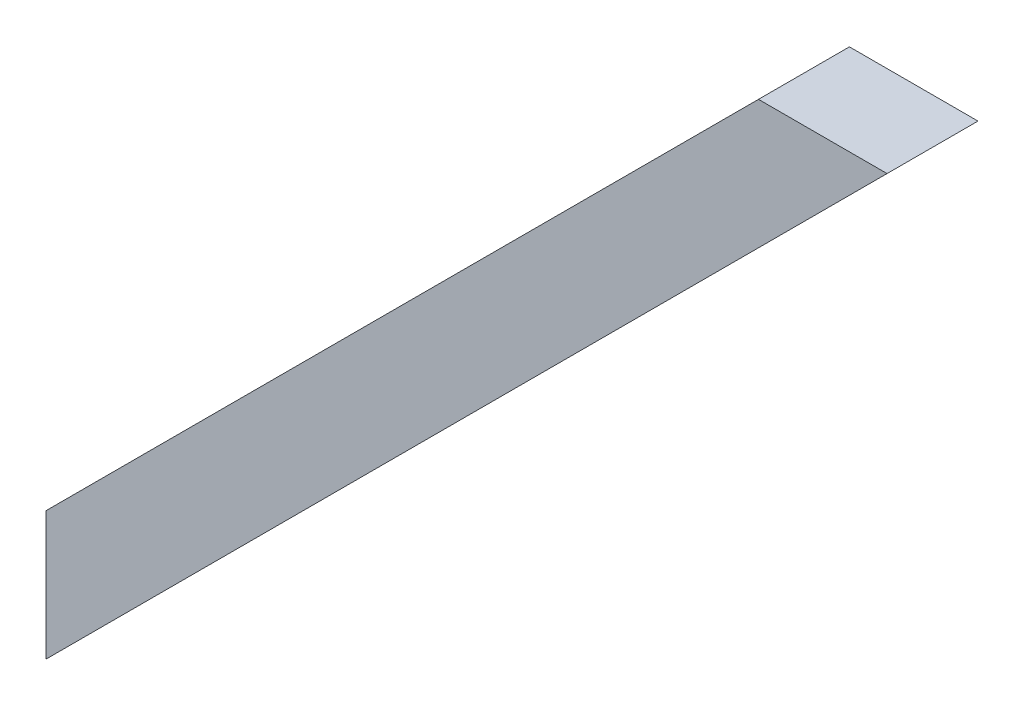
ISO-10303-21;
HEADER;
FILE_DESCRIPTION(('STEP AP214'),'2;1');
FILE_NAME('part.step','',(''),(''),'','','');
FILE_SCHEMA(('AUTOMOTIVE_DESIGN { 1 0 10303 214 1 1 1 1 }'));
ENDSEC;
DATA;
#1=APPLICATION_CONTEXT('core data for automotive mechanical design processes');
#2=APPLICATION_PROTOCOL_DEFINITION('international standard','automotive_design',2000,#1);
#3=PRODUCT_CONTEXT('',#1,'mechanical');
#4=PRODUCT('Part','Part','',(#3));
#5=PRODUCT_RELATED_PRODUCT_CATEGORY('part','',(#4));
#6=PRODUCT_DEFINITION_FORMATION('','',#4);
#7=PRODUCT_DEFINITION_CONTEXT('part definition',#1,'design');
#8=PRODUCT_DEFINITION('design','',#6,#7);
#9=PRODUCT_DEFINITION_SHAPE('','',#8);
#10=(LENGTH_UNIT() NAMED_UNIT(*) SI_UNIT(.MILLI.,.METRE.));
#11=(NAMED_UNIT(*) PLANE_ANGLE_UNIT() SI_UNIT($,.RADIAN.));
#12=(NAMED_UNIT(*) SI_UNIT($,.STERADIAN.) SOLID_ANGLE_UNIT());
#13=UNCERTAINTY_MEASURE_WITH_UNIT(LENGTH_MEASURE(1.E-05),#10,'distance_accuracy_value','');
#14=(GEOMETRIC_REPRESENTATION_CONTEXT(3) GLOBAL_UNCERTAINTY_ASSIGNED_CONTEXT((#13)) GLOBAL_UNIT_ASSIGNED_CONTEXT((#10,
#11,#12)) REPRESENTATION_CONTEXT('',''));
#15=CARTESIAN_POINT('',(0.,0.,0.));
#16=DIRECTION('',(0.,0.,1.));
#17=DIRECTION('',(1.,0.,0.));
#18=AXIS2_PLACEMENT_3D('',#15,#16,#17);
#19=CARTESIAN_POINT('',(0.,0.,-40.));
#20=DIRECTION('',(-1.,0.,0.));
#21=DIRECTION('',(0.,-1.,0.));
#22=AXIS2_PLACEMENT_3D('',#19,#20,#21);
#23=PLANE('',#22);
#24=DIRECTION('',(0.,-1.,0.));
#25=VECTOR('',#24,1.);
#26=CARTESIAN_POINT('',(0.,0.,0.));
#27=LINE('',#26,#25);
#28=CARTESIAN_POINT('',(-5.55111512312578E-12,56.5685424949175,0.));
#29=VERTEX_POINT('',#28);
#30=CARTESIAN_POINT('',(0.,0.,0.));
#31=VERTEX_POINT('',#30);
#32=EDGE_CURVE('E92',#29,#31,#27,.T.);
#33=ORIENTED_EDGE('',*,*,#32,.F.);
#34=DIRECTION('',(0.,0.,1.));
#35=VECTOR('',#34,1.);
#36=CARTESIAN_POINT('',(-5.60662627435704E-12,56.5685424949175,-40.));
#37=LINE('',#36,#35);
#38=CARTESIAN_POINT('',(-5.60662627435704E-12,56.5685424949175,-40.));
#39=VERTEX_POINT('',#38);
#40=EDGE_CURVE('E11',#39,#29,#37,.T.);
#41=ORIENTED_EDGE('',*,*,#40,.F.);
#42=DIRECTION('',(0.,-1.,0.));
#43=VECTOR('',#42,1.);
#44=CARTESIAN_POINT('',(0.,0.,-40.));
#45=LINE('',#44,#43);
#46=CARTESIAN_POINT('',(0.,0.,-40.));
#47=VERTEX_POINT('',#46);
#48=EDGE_CURVE('E86',#39,#47,#45,.T.);
#49=ORIENTED_EDGE('',*,*,#48,.T.);
#50=DIRECTION('',(0.,0.,1.));
#51=VECTOR('',#50,1.);
#52=CARTESIAN_POINT('',(0.,0.,-40.));
#53=LINE('',#52,#51);
#54=EDGE_CURVE('E31',#47,#31,#53,.T.);
#55=ORIENTED_EDGE('',*,*,#54,.T.);
#56=EDGE_LOOP('',(#33,#41,#49,#55));
#57=FACE_BOUND('',#56,.T.);
#58=ADVANCED_FACE('F28',(#57),#23,.T.);
#59=CARTESIAN_POINT('',(-5.60662627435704E-12,56.5685424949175,-40.));
#60=DIRECTION('',(-0.707106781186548,0.707106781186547,0.));
#61=DIRECTION('',(-0.707106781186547,-0.707106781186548,0.));
#62=AXIS2_PLACEMENT_3D('',#59,#60,#61);
#63=PLANE('',#62);
#64=DIRECTION('',(-0.707106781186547,-0.707106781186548,0.));
#65=VECTOR('',#64,1.);
#66=CARTESIAN_POINT('',(-5.55111512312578E-12,56.5685424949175,0.));
#67=LINE('',#66,#65);
#68=CARTESIAN_POINT('',(313.431457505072,369.999999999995,0.));
#69=VERTEX_POINT('',#68);
#70=EDGE_CURVE('E88',#69,#29,#67,.T.);
#71=ORIENTED_EDGE('',*,*,#70,.F.);
#72=DIRECTION('',(0.,0.,1.));
#73=VECTOR('',#72,1.);
#74=CARTESIAN_POINT('',(313.431457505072,369.999999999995,-40.));
#75=LINE('',#74,#73);
#76=CARTESIAN_POINT('',(313.431457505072,369.999999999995,-40.));
#77=VERTEX_POINT('',#76);
#78=EDGE_CURVE('E37',#77,#69,#75,.T.);
#79=ORIENTED_EDGE('',*,*,#78,.F.);
#80=DIRECTION('',(-0.707106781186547,-0.707106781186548,0.));
#81=VECTOR('',#80,1.);
#82=CARTESIAN_POINT('',(-5.60662627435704E-12,56.5685424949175,-40.));
#83=LINE('',#82,#81);
#84=EDGE_CURVE('E83',#77,#39,#83,.T.);
#85=ORIENTED_EDGE('',*,*,#84,.T.);
#86=ORIENTED_EDGE('',*,*,#40,.T.);
#87=EDGE_LOOP('',(#71,#79,#85,#86));
#88=FACE_BOUND('',#87,.T.);
#89=ADVANCED_FACE('F102',(#88),#63,.T.);
#90=CARTESIAN_POINT('',(313.431457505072,369.999999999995,-40.));
#91=DIRECTION('',(0.,1.,0.));
#92=DIRECTION('',(-1.,0.,0.));
#93=AXIS2_PLACEMENT_3D('',#90,#91,#92);
#94=PLANE('',#93);
#95=DIRECTION('',(-1.,0.,0.));
#96=VECTOR('',#95,1.);
#97=CARTESIAN_POINT('',(313.431457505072,369.999999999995,0.));
#98=LINE('',#97,#96);
#99=CARTESIAN_POINT('',(369.999999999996,369.999999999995,0.));
#100=VERTEX_POINT('',#99);
#101=EDGE_CURVE('E78',#100,#69,#98,.T.);
#102=ORIENTED_EDGE('',*,*,#101,.F.);
#103=DIRECTION('',(0.,0.,1.));
#104=VECTOR('',#103,1.);
#105=CARTESIAN_POINT('',(369.999999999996,369.999999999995,-40.));
#106=LINE('',#105,#104);
#107=CARTESIAN_POINT('',(369.999999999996,369.999999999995,-40.));
#108=VERTEX_POINT('',#107);
#109=EDGE_CURVE('E73',#108,#100,#106,.T.);
#110=ORIENTED_EDGE('',*,*,#109,.F.);
#111=DIRECTION('',(-1.,0.,0.));
#112=VECTOR('',#111,1.);
#113=CARTESIAN_POINT('',(313.431457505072,369.999999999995,-40.));
#114=LINE('',#113,#112);
#115=EDGE_CURVE('E76',#108,#77,#114,.T.);
#116=ORIENTED_EDGE('',*,*,#115,.T.);
#117=ORIENTED_EDGE('',*,*,#78,.T.);
#118=EDGE_LOOP('',(#102,#110,#116,#117));
#119=FACE_BOUND('',#118,.T.);
#120=ADVANCED_FACE('F75',(#119),#94,.T.);
#121=CARTESIAN_POINT('',(369.999999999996,369.999999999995,-40.));
#122=DIRECTION('',(0.707106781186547,-0.707106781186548,0.));
#123=DIRECTION('',(0.707106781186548,0.707106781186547,0.));
#124=AXIS2_PLACEMENT_3D('',#121,#122,#123);
#125=PLANE('',#124);
#126=DIRECTION('',(0.707106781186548,0.707106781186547,0.));
#127=VECTOR('',#126,1.);
#128=CARTESIAN_POINT('',(369.999999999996,369.999999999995,0.));
#129=LINE('',#128,#127);
#130=EDGE_CURVE('E95',#31,#100,#129,.T.);
#131=ORIENTED_EDGE('',*,*,#130,.F.);
#132=ORIENTED_EDGE('',*,*,#54,.F.);
#133=DIRECTION('',(0.707106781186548,0.707106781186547,0.));
#134=VECTOR('',#133,1.);
#135=CARTESIAN_POINT('',(369.999999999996,369.999999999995,-40.));
#136=LINE('',#135,#134);
#137=EDGE_CURVE('E82',#47,#108,#136,.T.);
#138=ORIENTED_EDGE('',*,*,#137,.T.);
#139=ORIENTED_EDGE('',*,*,#109,.T.);
#140=EDGE_LOOP('',(#131,#132,#138,#139));
#141=FACE_BOUND('',#140,.T.);
#142=ADVANCED_FACE('F85',(#141),#125,.T.);
#143=CARTESIAN_POINT('',(0.,0.,-40.));
#144=DIRECTION('',(0.,0.,-1.));
#145=DIRECTION('',(-1.,0.,0.));
#146=AXIS2_PLACEMENT_3D('',#143,#144,#145);
#147=PLANE('',#146);
#148=ORIENTED_EDGE('',*,*,#48,.F.);
#149=ORIENTED_EDGE('',*,*,#84,.F.);
#150=ORIENTED_EDGE('',*,*,#115,.F.);
#151=ORIENTED_EDGE('',*,*,#137,.F.);
#152=EDGE_LOOP('',(#148,#149,#150,#151));
#153=FACE_BOUND('',#152,.T.);
#154=ADVANCED_FACE('F81',(#153),#147,.T.);
#155=CARTESIAN_POINT('',(0.,0.,0.));
#156=DIRECTION('',(0.,0.,-1.));
#157=DIRECTION('',(-1.,0.,0.));
#158=AXIS2_PLACEMENT_3D('',#155,#156,#157);
#159=PLANE('',#158);
#160=ORIENTED_EDGE('',*,*,#32,.T.);
#161=ORIENTED_EDGE('',*,*,#130,.T.);
#162=ORIENTED_EDGE('',*,*,#101,.T.);
#163=ORIENTED_EDGE('',*,*,#70,.T.);
#164=EDGE_LOOP('',(#160,#161,#162,#163));
#165=FACE_BOUND('',#164,.T.);
#166=ADVANCED_FACE('F101',(#165),#159,.F.);
#167=CLOSED_SHELL('',(#58,#89,#120,#142,#154,#166));
#168=MANIFOLD_SOLID_BREP('B2',#167);
#169=ADVANCED_BREP_SHAPE_REPRESENTATION('',(#18,#168),#14);
#170=SHAPE_DEFINITION_REPRESENTATION(#9,#169);
ENDSEC;
END-ISO-10303-21;
